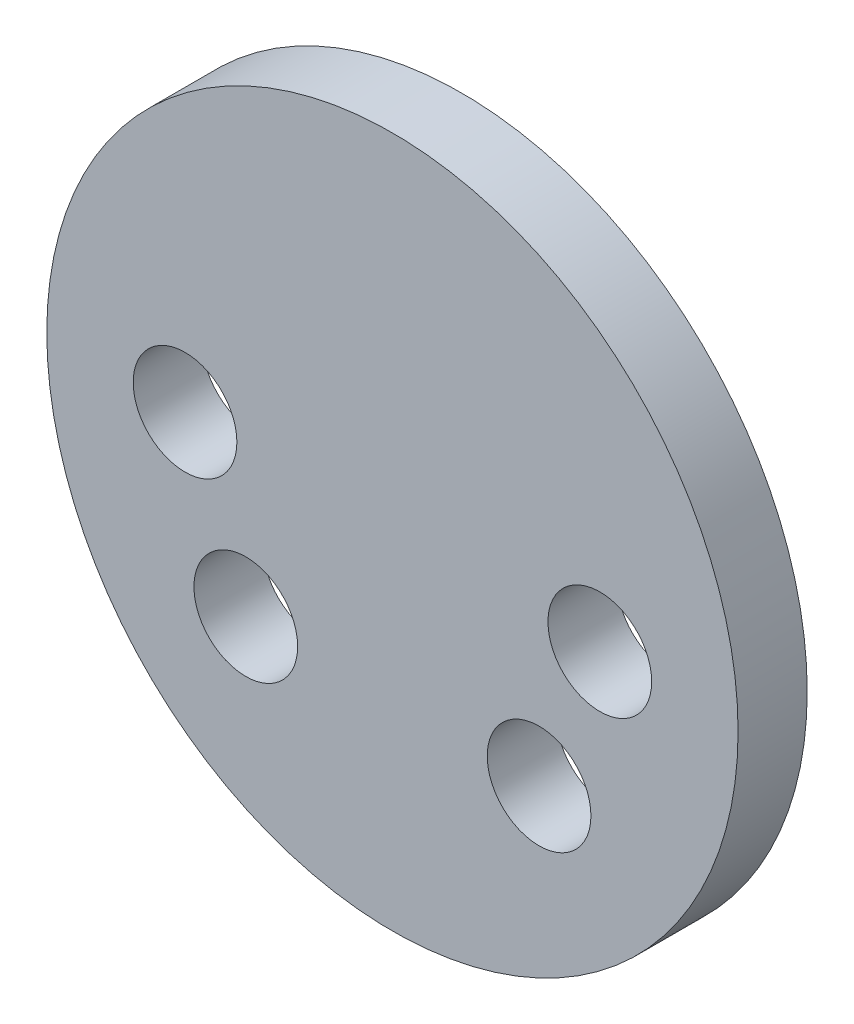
ISO-10303-21;
HEADER;
FILE_DESCRIPTION(('STEP AP214'),'2;1');
FILE_NAME('part.step','',(''),(''),'','','');
FILE_SCHEMA(('AUTOMOTIVE_DESIGN { 1 0 10303 214 1 1 1 1 }'));
ENDSEC;
DATA;
#1=APPLICATION_CONTEXT('core data for automotive mechanical design processes');
#2=APPLICATION_PROTOCOL_DEFINITION('international standard','automotive_design',2000,#1);
#3=PRODUCT_CONTEXT('',#1,'mechanical');
#4=PRODUCT('Part','Part','',(#3));
#5=PRODUCT_RELATED_PRODUCT_CATEGORY('part','',(#4));
#6=PRODUCT_DEFINITION_FORMATION('','',#4);
#7=PRODUCT_DEFINITION_CONTEXT('part definition',#1,'design');
#8=PRODUCT_DEFINITION('design','',#6,#7);
#9=PRODUCT_DEFINITION_SHAPE('','',#8);
#10=(LENGTH_UNIT() NAMED_UNIT(*) SI_UNIT(.MILLI.,.METRE.));
#11=(NAMED_UNIT(*) PLANE_ANGLE_UNIT() SI_UNIT($,.RADIAN.));
#12=(NAMED_UNIT(*) SI_UNIT($,.STERADIAN.) SOLID_ANGLE_UNIT());
#13=UNCERTAINTY_MEASURE_WITH_UNIT(LENGTH_MEASURE(1.E-05),#10,'distance_accuracy_value','');
#14=(GEOMETRIC_REPRESENTATION_CONTEXT(3) GLOBAL_UNCERTAINTY_ASSIGNED_CONTEXT((#13)) GLOBAL_UNIT_ASSIGNED_CONTEXT((#10,
#11,#12)) REPRESENTATION_CONTEXT('',''));
#15=CARTESIAN_POINT('',(0.,0.,0.));
#16=DIRECTION('',(0.,0.,1.));
#17=DIRECTION('',(1.,0.,0.));
#18=AXIS2_PLACEMENT_3D('',#15,#16,#17);
#19=CARTESIAN_POINT('',(0.,0.,10.));
#20=DIRECTION('',(0.,0.,1.));
#21=DIRECTION('',(1.,0.,0.));
#22=AXIS2_PLACEMENT_3D('',#19,#20,#21);
#23=PLANE('',#22);
#24=CARTESIAN_POINT('',(21.2132034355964,-21.2132034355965,10.));
#25=DIRECTION('',(0.,0.,1.));
#26=DIRECTION('',(1.,0.,0.));
#27=AXIS2_PLACEMENT_3D('',#24,#25,#26);
#28=CIRCLE('',#27,7.5);
#29=CARTESIAN_POINT('',(28.7132034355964,-21.2132034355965,10.));
#30=VERTEX_POINT('',#29);
#31=EDGE_CURVE('E57',#30,#30,#28,.T.);
#32=ORIENTED_EDGE('',*,*,#31,.F.);
#33=EDGE_LOOP('',(#32));
#34=FACE_BOUND('',#33,.T.);
#35=CARTESIAN_POINT('',(-30.,0.,10.));
#36=DIRECTION('',(0.,0.,1.));
#37=DIRECTION('',(1.,0.,0.));
#38=AXIS2_PLACEMENT_3D('',#35,#36,#37);
#39=CIRCLE('',#38,7.5);
#40=CARTESIAN_POINT('',(-22.5,0.,10.));
#41=VERTEX_POINT('',#40);
#42=EDGE_CURVE('E42',#41,#41,#39,.T.);
#43=ORIENTED_EDGE('',*,*,#42,.F.);
#44=EDGE_LOOP('',(#43));
#45=FACE_BOUND('',#44,.T.);
#46=CARTESIAN_POINT('',(0.,0.,10.));
#47=DIRECTION('',(0.,0.,1.));
#48=DIRECTION('',(1.,0.,0.));
#49=AXIS2_PLACEMENT_3D('',#46,#47,#48);
#50=CIRCLE('',#49,50.);
#51=CARTESIAN_POINT('',(50.,0.,10.));
#52=VERTEX_POINT('',#51);
#53=EDGE_CURVE('E10',#52,#52,#50,.T.);
#54=ORIENTED_EDGE('',*,*,#53,.T.);
#55=EDGE_LOOP('',(#54));
#56=FACE_BOUND('',#55,.T.);
#57=CARTESIAN_POINT('',(-21.2132034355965,-21.2132034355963,10.));
#58=DIRECTION('',(0.,0.,1.));
#59=DIRECTION('',(1.,0.,0.));
#60=AXIS2_PLACEMENT_3D('',#57,#58,#59);
#61=CIRCLE('',#60,7.5);
#62=CARTESIAN_POINT('',(-13.7132034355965,-21.2132034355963,10.));
#63=VERTEX_POINT('',#62);
#64=EDGE_CURVE('E51',#63,#63,#61,.T.);
#65=ORIENTED_EDGE('',*,*,#64,.F.);
#66=EDGE_LOOP('',(#65));
#67=FACE_BOUND('',#66,.T.);
#68=CARTESIAN_POINT('',(30.,0.,10.));
#69=DIRECTION('',(0.,0.,1.));
#70=DIRECTION('',(1.,0.,0.));
#71=AXIS2_PLACEMENT_3D('',#68,#69,#70);
#72=CIRCLE('',#71,7.5);
#73=CARTESIAN_POINT('',(37.5,0.,10.));
#74=VERTEX_POINT('',#73);
#75=EDGE_CURVE('E63',#74,#74,#72,.T.);
#76=ORIENTED_EDGE('',*,*,#75,.F.);
#77=EDGE_LOOP('',(#76));
#78=FACE_BOUND('',#77,.T.);
#79=ADVANCED_FACE('F31',(#34,#45,#56,#67,#78),#23,.T.);
#80=CARTESIAN_POINT('',(0.,0.,0.));
#81=DIRECTION('',(0.,0.,1.));
#82=DIRECTION('',(1.,0.,0.));
#83=AXIS2_PLACEMENT_3D('',#80,#81,#82);
#84=PLANE('',#83);
#85=CARTESIAN_POINT('',(21.2132034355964,-21.2132034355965,0.));
#86=DIRECTION('',(0.,0.,1.));
#87=DIRECTION('',(1.,0.,0.));
#88=AXIS2_PLACEMENT_3D('',#85,#86,#87);
#89=CIRCLE('',#88,7.5);
#90=CARTESIAN_POINT('',(28.7132034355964,-21.2132034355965,0.));
#91=VERTEX_POINT('',#90);
#92=EDGE_CURVE('E60',#91,#91,#89,.T.);
#93=ORIENTED_EDGE('',*,*,#92,.T.);
#94=EDGE_LOOP('',(#93));
#95=FACE_BOUND('',#94,.T.);
#96=CARTESIAN_POINT('',(-30.,0.,0.));
#97=DIRECTION('',(0.,0.,1.));
#98=DIRECTION('',(1.,0.,0.));
#99=AXIS2_PLACEMENT_3D('',#96,#97,#98);
#100=CIRCLE('',#99,7.5);
#101=CARTESIAN_POINT('',(-22.5,0.,0.));
#102=VERTEX_POINT('',#101);
#103=EDGE_CURVE('E46',#102,#102,#100,.T.);
#104=ORIENTED_EDGE('',*,*,#103,.T.);
#105=EDGE_LOOP('',(#104));
#106=FACE_BOUND('',#105,.T.);
#107=CARTESIAN_POINT('',(0.,0.,0.));
#108=DIRECTION('',(0.,0.,1.));
#109=DIRECTION('',(1.,0.,0.));
#110=AXIS2_PLACEMENT_3D('',#107,#108,#109);
#111=CIRCLE('',#110,50.);
#112=CARTESIAN_POINT('',(50.,0.,0.));
#113=VERTEX_POINT('',#112);
#114=EDGE_CURVE('E38',#113,#113,#111,.T.);
#115=ORIENTED_EDGE('',*,*,#114,.F.);
#116=EDGE_LOOP('',(#115));
#117=FACE_BOUND('',#116,.T.);
#118=CARTESIAN_POINT('',(-21.2132034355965,-21.2132034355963,0.));
#119=DIRECTION('',(0.,0.,1.));
#120=DIRECTION('',(1.,0.,0.));
#121=AXIS2_PLACEMENT_3D('',#118,#119,#120);
#122=CIRCLE('',#121,7.5);
#123=CARTESIAN_POINT('',(-13.7132034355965,-21.2132034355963,0.));
#124=VERTEX_POINT('',#123);
#125=EDGE_CURVE('E54',#124,#124,#122,.T.);
#126=ORIENTED_EDGE('',*,*,#125,.T.);
#127=EDGE_LOOP('',(#126));
#128=FACE_BOUND('',#127,.T.);
#129=CARTESIAN_POINT('',(30.,0.,0.));
#130=DIRECTION('',(0.,0.,1.));
#131=DIRECTION('',(1.,0.,0.));
#132=AXIS2_PLACEMENT_3D('',#129,#130,#131);
#133=CIRCLE('',#132,7.5);
#134=CARTESIAN_POINT('',(37.5,0.,0.));
#135=VERTEX_POINT('',#134);
#136=EDGE_CURVE('E66',#135,#135,#133,.T.);
#137=ORIENTED_EDGE('',*,*,#136,.T.);
#138=EDGE_LOOP('',(#137));
#139=FACE_BOUND('',#138,.T.);
#140=ADVANCED_FACE('F70',(#95,#106,#117,#128,#139),#84,.F.);
#141=CARTESIAN_POINT('',(0.,0.,10.));
#142=DIRECTION('',(0.,0.,-1.));
#143=DIRECTION('',(-1.,0.,0.));
#144=AXIS2_PLACEMENT_3D('',#141,#142,#143);
#145=CYLINDRICAL_SURFACE('',#144,50.);
#146=ORIENTED_EDGE('',*,*,#53,.F.);
#147=EDGE_LOOP('',(#146));
#148=FACE_BOUND('',#147,.T.);
#149=ORIENTED_EDGE('',*,*,#114,.T.);
#150=EDGE_LOOP('',(#149));
#151=FACE_BOUND('',#150,.T.);
#152=ADVANCED_FACE('F33',(#148,#151),#145,.T.);
#153=CARTESIAN_POINT('',(-30.,0.,10.));
#154=DIRECTION('',(0.,0.,-1.));
#155=DIRECTION('',(-1.,0.,0.));
#156=AXIS2_PLACEMENT_3D('',#153,#154,#155);
#157=CYLINDRICAL_SURFACE('',#156,7.5);
#158=ORIENTED_EDGE('',*,*,#42,.T.);
#159=EDGE_LOOP('',(#158));
#160=FACE_BOUND('',#159,.T.);
#161=ORIENTED_EDGE('',*,*,#103,.F.);
#162=EDGE_LOOP('',(#161));
#163=FACE_BOUND('',#162,.T.);
#164=ADVANCED_FACE('F93',(#160,#163),#157,.F.);
#165=CARTESIAN_POINT('',(-21.2132034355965,-21.2132034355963,10.));
#166=DIRECTION('',(0.,0.,-1.));
#167=DIRECTION('',(-1.,0.,0.));
#168=AXIS2_PLACEMENT_3D('',#165,#166,#167);
#169=CYLINDRICAL_SURFACE('',#168,7.5);
#170=ORIENTED_EDGE('',*,*,#64,.T.);
#171=EDGE_LOOP('',(#170));
#172=FACE_BOUND('',#171,.T.);
#173=ORIENTED_EDGE('',*,*,#125,.F.);
#174=EDGE_LOOP('',(#173));
#175=FACE_BOUND('',#174,.T.);
#176=ADVANCED_FACE('F80',(#172,#175),#169,.F.);
#177=CARTESIAN_POINT('',(21.2132034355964,-21.2132034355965,10.));
#178=DIRECTION('',(0.,0.,-1.));
#179=DIRECTION('',(-1.,0.,0.));
#180=AXIS2_PLACEMENT_3D('',#177,#178,#179);
#181=CYLINDRICAL_SURFACE('',#180,7.5);
#182=ORIENTED_EDGE('',*,*,#31,.T.);
#183=EDGE_LOOP('',(#182));
#184=FACE_BOUND('',#183,.T.);
#185=ORIENTED_EDGE('',*,*,#92,.F.);
#186=EDGE_LOOP('',(#185));
#187=FACE_BOUND('',#186,.T.);
#188=ADVANCED_FACE('F74',(#184,#187),#181,.F.);
#189=CARTESIAN_POINT('',(30.,0.,10.));
#190=DIRECTION('',(0.,0.,-1.));
#191=DIRECTION('',(-1.,0.,0.));
#192=AXIS2_PLACEMENT_3D('',#189,#190,#191);
#193=CYLINDRICAL_SURFACE('',#192,7.5);
#194=ORIENTED_EDGE('',*,*,#75,.T.);
#195=EDGE_LOOP('',(#194));
#196=FACE_BOUND('',#195,.T.);
#197=ORIENTED_EDGE('',*,*,#136,.F.);
#198=EDGE_LOOP('',(#197));
#199=FACE_BOUND('',#198,.T.);
#200=ADVANCED_FACE('F72',(#196,#199),#193,.F.);
#201=CLOSED_SHELL('',(#79,#140,#152,#164,#176,#188,#200));
#202=MANIFOLD_SOLID_BREP('B2',#201);
#203=ADVANCED_BREP_SHAPE_REPRESENTATION('',(#18,#202),#14);
#204=SHAPE_DEFINITION_REPRESENTATION(#9,#203);
ENDSEC;
END-ISO-10303-21;
